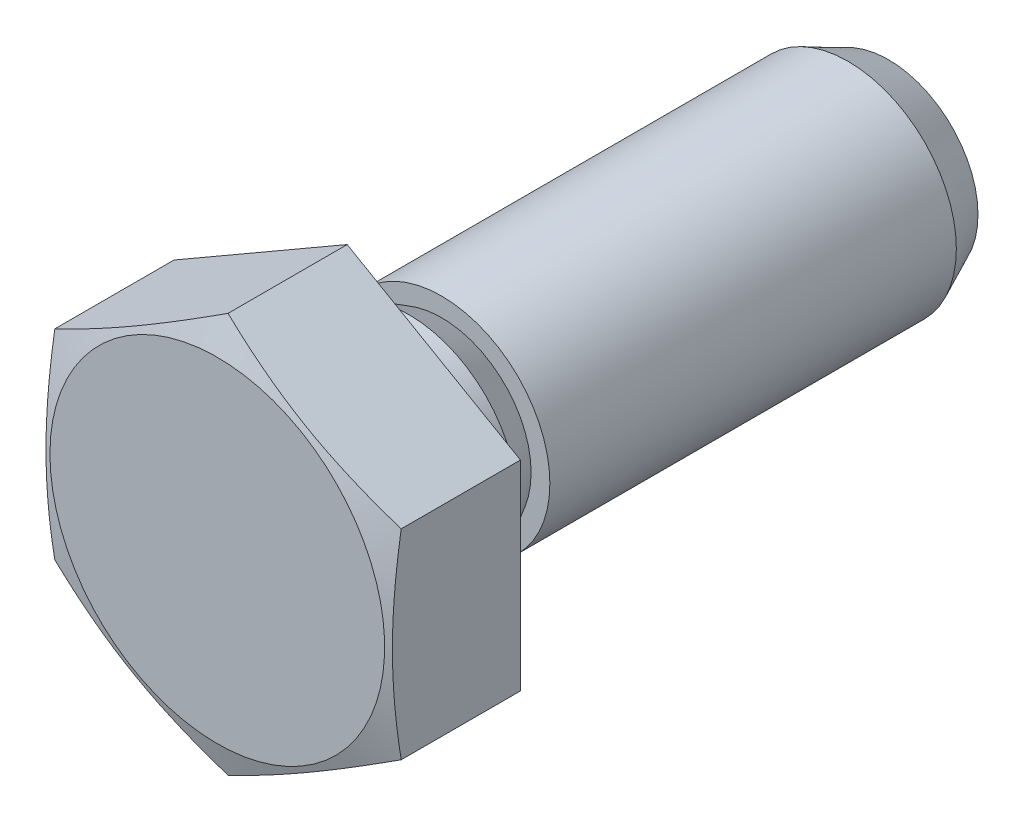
ISO-10303-21;
HEADER;
FILE_DESCRIPTION(('STEP AP214'),'2;1');
FILE_NAME('part.step','',(''),(''),'','','');
FILE_SCHEMA(('AUTOMOTIVE_DESIGN { 1 0 10303 214 1 1 1 1 }'));
ENDSEC;
DATA;
#1=APPLICATION_CONTEXT('core data for automotive mechanical design processes');
#2=APPLICATION_PROTOCOL_DEFINITION('international standard','automotive_design',2000,#1);
#3=PRODUCT_CONTEXT('',#1,'mechanical');
#4=PRODUCT('Part','Part','',(#3));
#5=PRODUCT_RELATED_PRODUCT_CATEGORY('part','',(#4));
#6=PRODUCT_DEFINITION_FORMATION('','',#4);
#7=PRODUCT_DEFINITION_CONTEXT('part definition',#1,'design');
#8=PRODUCT_DEFINITION('design','',#6,#7);
#9=PRODUCT_DEFINITION_SHAPE('','',#8);
#10=(LENGTH_UNIT() NAMED_UNIT(*) SI_UNIT(.MILLI.,.METRE.));
#11=(NAMED_UNIT(*) PLANE_ANGLE_UNIT() SI_UNIT($,.RADIAN.));
#12=(NAMED_UNIT(*) SI_UNIT($,.STERADIAN.) SOLID_ANGLE_UNIT());
#13=UNCERTAINTY_MEASURE_WITH_UNIT(LENGTH_MEASURE(1.E-05),#10,'distance_accuracy_value','');
#14=(GEOMETRIC_REPRESENTATION_CONTEXT(3) GLOBAL_UNCERTAINTY_ASSIGNED_CONTEXT((#13)) GLOBAL_UNIT_ASSIGNED_CONTEXT((#10,
#11,#12)) REPRESENTATION_CONTEXT('',''));
#15=CARTESIAN_POINT('',(0.,0.,0.));
#16=DIRECTION('',(0.,0.,1.));
#17=DIRECTION('',(1.,0.,0.));
#18=AXIS2_PLACEMENT_3D('',#15,#16,#17);
#19=CARTESIAN_POINT('',(0.,0.,0.5));
#20=DIRECTION('',(0.,0.,1.));
#21=DIRECTION('',(1.,0.,0.));
#22=AXIS2_PLACEMENT_3D('',#19,#20,#21);
#23=TOROIDAL_SURFACE('',#22,2.94,0.5);
#24=CARTESIAN_POINT('',(0.,0.,0.5));
#25=DIRECTION('',(0.,0.,1.));
#26=DIRECTION('',(1.,0.,0.));
#27=AXIS2_PLACEMENT_3D('',#24,#25,#26);
#28=CIRCLE('',#27,3.44);
#29=CARTESIAN_POINT('',(3.44,0.,0.5));
#30=VERTEX_POINT('',#29);
#31=EDGE_CURVE('E10',#30,#30,#28,.T.);
#32=ORIENTED_EDGE('',*,*,#31,.F.);
#33=EDGE_LOOP('',(#32));
#34=FACE_BOUND('',#33,.T.);
#35=CARTESIAN_POINT('',(0.,0.,0.));
#36=DIRECTION('',(0.,0.,1.));
#37=DIRECTION('',(1.,0.,0.));
#38=AXIS2_PLACEMENT_3D('',#35,#36,#37);
#39=CIRCLE('',#38,2.94);
#40=CARTESIAN_POINT('',(2.94,0.,0.));
#41=VERTEX_POINT('',#40);
#42=EDGE_CURVE('E22',#41,#41,#39,.T.);
#43=ORIENTED_EDGE('',*,*,#42,.T.);
#44=EDGE_LOOP('',(#43));
#45=FACE_BOUND('',#44,.T.);
#46=ADVANCED_FACE('F15',(#34,#45),#23,.T.);
#47=CARTESIAN_POINT('',(0.,2.94,0.));
#48=DIRECTION('',(0.,0.,-1.));
#49=DIRECTION('',(-1.,0.,0.));
#50=AXIS2_PLACEMENT_3D('',#47,#48,#49);
#51=PLANE('',#50);
#52=CARTESIAN_POINT('',(0.,0.,0.));
#53=DIRECTION('',(0.,0.,1.));
#54=DIRECTION('',(1.,0.,0.));
#55=AXIS2_PLACEMENT_3D('',#52,#53,#54);
#56=CIRCLE('',#55,2.75);
#57=CARTESIAN_POINT('',(2.75,0.,0.));
#58=VERTEX_POINT('',#57);
#59=EDGE_CURVE('E116',#58,#58,#56,.T.);
#60=ORIENTED_EDGE('',*,*,#59,.T.);
#61=EDGE_LOOP('',(#60));
#62=FACE_BOUND('',#61,.T.);
#63=ORIENTED_EDGE('',*,*,#42,.F.);
#64=EDGE_LOOP('',(#63));
#65=FACE_BOUND('',#64,.T.);
#66=ADVANCED_FACE('F122',(#62,#65),#51,.T.);
#67=CARTESIAN_POINT('',(0.,0.,-0.25));
#68=DIRECTION('',(0.,0.,1.));
#69=DIRECTION('',(1.,0.,0.));
#70=AXIS2_PLACEMENT_3D('',#67,#68,#69);
#71=TOROIDAL_SURFACE('',#70,2.75,0.25);
#72=CARTESIAN_POINT('',(0.,0.,-0.25));
#73=DIRECTION('',(0.,0.,1.));
#74=DIRECTION('',(1.,0.,0.));
#75=AXIS2_PLACEMENT_3D('',#72,#73,#74);
#76=CIRCLE('',#75,2.5);
#77=CARTESIAN_POINT('',(2.5,0.,-0.25));
#78=VERTEX_POINT('',#77);
#79=EDGE_CURVE('E113',#78,#78,#76,.T.);
#80=ORIENTED_EDGE('',*,*,#79,.T.);
#81=EDGE_LOOP('',(#80));
#82=FACE_BOUND('',#81,.T.);
#83=ORIENTED_EDGE('',*,*,#59,.F.);
#84=EDGE_LOOP('',(#83));
#85=FACE_BOUND('',#84,.T.);
#86=ADVANCED_FACE('F124',(#82,#85),#71,.F.);
#87=CARTESIAN_POINT('',(0.,0.,0.5));
#88=DIRECTION('',(0.,0.,1.));
#89=DIRECTION('',(1.,0.,0.));
#90=AXIS2_PLACEMENT_3D('',#87,#88,#89);
#91=CYLINDRICAL_SURFACE('',#90,2.5);
#92=CARTESIAN_POINT('',(0.,0.,-0.930022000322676));
#93=DIRECTION('',(0.,0.,1.));
#94=DIRECTION('',(1.,0.,0.));
#95=AXIS2_PLACEMENT_3D('',#92,#93,#94);
#96=CIRCLE('',#95,2.5);
#97=CARTESIAN_POINT('',(2.5,0.,-0.930022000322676));
#98=VERTEX_POINT('',#97);
#99=EDGE_CURVE('E110',#98,#98,#96,.T.);
#100=ORIENTED_EDGE('',*,*,#99,.T.);
#101=EDGE_LOOP('',(#100));
#102=FACE_BOUND('',#101,.T.);
#103=ORIENTED_EDGE('',*,*,#79,.F.);
#104=EDGE_LOOP('',(#103));
#105=FACE_BOUND('',#104,.T.);
#106=ADVANCED_FACE('F131',(#102,#105),#91,.T.);
#107=CARTESIAN_POINT('',(0.,0.,-0.930022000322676));
#108=DIRECTION('',(0.,0.,1.));
#109=DIRECTION('',(1.,0.,0.));
#110=AXIS2_PLACEMENT_3D('',#107,#108,#109);
#111=CONICAL_SURFACE('',#110,2.5,0.523598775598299);
#112=CARTESIAN_POINT('',(0.,0.,-1.68));
#113=DIRECTION('',(0.,0.,1.));
#114=DIRECTION('',(1.,0.,0.));
#115=AXIS2_PLACEMENT_3D('',#112,#113,#114);
#116=CIRCLE('',#115,2.067);
#117=CARTESIAN_POINT('',(2.067,0.,-1.68));
#118=VERTEX_POINT('',#117);
#119=EDGE_CURVE('E107',#118,#118,#116,.T.);
#120=ORIENTED_EDGE('',*,*,#119,.T.);
#121=EDGE_LOOP('',(#120));
#122=FACE_BOUND('',#121,.T.);
#123=ORIENTED_EDGE('',*,*,#99,.F.);
#124=EDGE_LOOP('',(#123));
#125=FACE_BOUND('',#124,.T.);
#126=ADVANCED_FACE('F138',(#122,#125),#111,.T.);
#127=CARTESIAN_POINT('',(0.,2.067,-1.68));
#128=DIRECTION('',(0.,0.,1.));
#129=DIRECTION('',(1.,0.,0.));
#130=AXIS2_PLACEMENT_3D('',#127,#128,#129);
#131=PLANE('',#130);
#132=CARTESIAN_POINT('',(0.,0.,-1.68));
#133=DIRECTION('',(0.,0.,1.));
#134=DIRECTION('',(1.,0.,0.));
#135=AXIS2_PLACEMENT_3D('',#132,#133,#134);
#136=CIRCLE('',#135,2.5);
#137=CARTESIAN_POINT('',(2.5,0.,-1.68));
#138=VERTEX_POINT('',#137);
#139=EDGE_CURVE('E104',#138,#138,#136,.T.);
#140=ORIENTED_EDGE('',*,*,#139,.T.);
#141=EDGE_LOOP('',(#140));
#142=FACE_BOUND('',#141,.T.);
#143=ORIENTED_EDGE('',*,*,#119,.F.);
#144=EDGE_LOOP('',(#143));
#145=FACE_BOUND('',#144,.T.);
#146=ADVANCED_FACE('F142',(#142,#145),#131,.T.);
#147=CARTESIAN_POINT('',(0.,0.,0.5));
#148=DIRECTION('',(0.,0.,1.));
#149=DIRECTION('',(1.,0.,0.));
#150=AXIS2_PLACEMENT_3D('',#147,#148,#149);
#151=CYLINDRICAL_SURFACE('',#150,2.5);
#152=CARTESIAN_POINT('',(0.,0.,-11.067));
#153=DIRECTION('',(0.,0.,1.));
#154=DIRECTION('',(1.,0.,0.));
#155=AXIS2_PLACEMENT_3D('',#152,#153,#154);
#156=CIRCLE('',#155,2.5);
#157=CARTESIAN_POINT('',(2.5,0.,-11.067));
#158=VERTEX_POINT('',#157);
#159=EDGE_CURVE('E101',#158,#158,#156,.T.);
#160=ORIENTED_EDGE('',*,*,#159,.T.);
#161=EDGE_LOOP('',(#160));
#162=FACE_BOUND('',#161,.T.);
#163=ORIENTED_EDGE('',*,*,#139,.F.);
#164=EDGE_LOOP('',(#163));
#165=FACE_BOUND('',#164,.T.);
#166=ADVANCED_FACE('F146',(#162,#165),#151,.T.);
#167=CARTESIAN_POINT('',(0.,0.,-11.067));
#168=DIRECTION('',(0.,0.,1.));
#169=DIRECTION('',(1.,0.,0.));
#170=AXIS2_PLACEMENT_3D('',#167,#168,#169);
#171=CONICAL_SURFACE('',#170,2.5,0.43451274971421);
#172=CARTESIAN_POINT('',(0.,0.,-12.));
#173=DIRECTION('',(0.,0.,1.));
#174=DIRECTION('',(1.,0.,0.));
#175=AXIS2_PLACEMENT_3D('',#172,#173,#174);
#176=CIRCLE('',#175,2.067);
#177=CARTESIAN_POINT('',(2.067,0.,-12.));
#178=VERTEX_POINT('',#177);
#179=EDGE_CURVE('E98',#178,#178,#176,.T.);
#180=ORIENTED_EDGE('',*,*,#179,.T.);
#181=EDGE_LOOP('',(#180));
#182=FACE_BOUND('',#181,.T.);
#183=ORIENTED_EDGE('',*,*,#159,.F.);
#184=EDGE_LOOP('',(#183));
#185=FACE_BOUND('',#184,.T.);
#186=ADVANCED_FACE('F150',(#182,#185),#171,.T.);
#187=CARTESIAN_POINT('',(0.,2.067,-12.));
#188=DIRECTION('',(0.,0.,-1.));
#189=DIRECTION('',(-1.,0.,0.));
#190=AXIS2_PLACEMENT_3D('',#187,#188,#189);
#191=PLANE('',#190);
#192=ORIENTED_EDGE('',*,*,#179,.F.);
#193=EDGE_LOOP('',(#192));
#194=FACE_BOUND('',#193,.T.);
#195=ADVANCED_FACE('F154',(#194),#191,.T.);
#196=CARTESIAN_POINT('',(-4.,-2.3094,0.5));
#197=DIRECTION('',(0.,0.,-1.));
#198=DIRECTION('',(-1.,0.,0.));
#199=AXIS2_PLACEMENT_3D('',#196,#197,#198);
#200=PLANE('',#199);
#201=DIRECTION('',(0.,-1.,0.));
#202=VECTOR('',#201,1.);
#203=CARTESIAN_POINT('',(-4.,2.3094,0.5));
#204=LINE('',#203,#202);
#205=CARTESIAN_POINT('',(-4.,2.3094,0.5));
#206=VERTEX_POINT('',#205);
#207=CARTESIAN_POINT('',(-4.,-2.3094,0.5));
#208=VERTEX_POINT('',#207);
#209=EDGE_CURVE('E81',#206,#208,#204,.T.);
#210=ORIENTED_EDGE('',*,*,#209,.F.);
#211=DIRECTION('',(0.866025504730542,0.499999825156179,0.));
#212=VECTOR('',#211,1.);
#213=CARTESIAN_POINT('',(-4.,2.3094,0.5));
#214=LINE('',#213,#212);
#215=CARTESIAN_POINT('',(0.,4.6188,0.5));
#216=VERTEX_POINT('',#215);
#217=EDGE_CURVE('E86',#206,#216,#214,.T.);
#218=ORIENTED_EDGE('',*,*,#217,.T.);
#219=DIRECTION('',(0.866025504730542,-0.499999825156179,0.));
#220=VECTOR('',#219,1.);
#221=CARTESIAN_POINT('',(0.,4.6188,0.5));
#222=LINE('',#221,#220);
#223=CARTESIAN_POINT('',(4.,2.3094,0.5));
#224=VERTEX_POINT('',#223);
#225=EDGE_CURVE('E92',#216,#224,#222,.T.);
#226=ORIENTED_EDGE('',*,*,#225,.T.);
#227=DIRECTION('',(0.,-1.,0.));
#228=VECTOR('',#227,1.);
#229=CARTESIAN_POINT('',(4.,2.3094,0.5));
#230=LINE('',#229,#228);
#231=CARTESIAN_POINT('',(4.,-2.3094,0.5));
#232=VERTEX_POINT('',#231);
#233=EDGE_CURVE('E244',#224,#232,#230,.T.);
#234=ORIENTED_EDGE('',*,*,#233,.T.);
#235=DIRECTION('',(-0.866025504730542,-0.499999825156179,0.));
#236=VECTOR('',#235,1.);
#237=CARTESIAN_POINT('',(4.,-2.3094,0.5));
#238=LINE('',#237,#236);
#239=CARTESIAN_POINT('',(0.,-4.6188,0.5));
#240=VERTEX_POINT('',#239);
#241=EDGE_CURVE('E230',#232,#240,#238,.T.);
#242=ORIENTED_EDGE('',*,*,#241,.T.);
#243=DIRECTION('',(-0.866025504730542,0.499999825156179,0.));
#244=VECTOR('',#243,1.);
#245=CARTESIAN_POINT('',(0.,-4.6188,0.5));
#246=LINE('',#245,#244);
#247=EDGE_CURVE('E228',#240,#208,#246,.T.);
#248=ORIENTED_EDGE('',*,*,#247,.T.);
#249=EDGE_LOOP('',(#210,#218,#226,#234,#242,#248));
#250=FACE_BOUND('',#249,.T.);
#251=ORIENTED_EDGE('',*,*,#31,.T.);
#252=EDGE_LOOP('',(#251));
#253=FACE_BOUND('',#252,.T.);
#254=ADVANCED_FACE('F158',(#250,#253),#200,.T.);
#255=CARTESIAN_POINT('',(-4.,2.3094,0.5));
#256=DIRECTION('',(-1.,0.,0.));
#257=DIRECTION('',(0.,0.,1.));
#258=AXIS2_PLACEMENT_3D('',#255,#256,#257);
#259=PLANE('',#258);
#260=CARTESIAN_POINT('',(-4.,2.66662995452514,3.19024582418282));
#261=CARTESIAN_POINT('',(-4.,2.48418475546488,3.22350153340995));
#262=CARTESIAN_POINT('',(-4.,2.30129241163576,3.25449531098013));
#263=CARTESIAN_POINT('',(-4.,1.93455333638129,3.3109075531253));
#264=CARTESIAN_POINT('',(-4.,1.7507061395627,3.33632297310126));
#265=CARTESIAN_POINT('',(-4.,1.38237526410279,3.38046702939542));
#266=CARTESIAN_POINT('',(-4.,1.19789237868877,3.39920214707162));
#267=CARTESIAN_POINT('',(-4.,0.82833495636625,3.42902381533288));
#268=CARTESIAN_POINT('',(-4.,0.64326054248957,3.44011186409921));
#269=CARTESIAN_POINT('',(-4.,0.275434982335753,3.45386479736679));
#270=CARTESIAN_POINT('',(-4.,0.0926883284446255,3.45664750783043));
#271=CARTESIAN_POINT('',(-4.,-0.272751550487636,3.45394498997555));
#272=CARTESIAN_POINT('',(-4.,-0.455444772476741,3.44845935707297));
#273=CARTESIAN_POINT('',(-4.,-0.820363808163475,3.42957062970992));
#274=CARTESIAN_POINT('',(-4.,-1.00258973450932,3.41616966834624));
#275=CARTESIAN_POINT('',(-4.,-1.36636648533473,3.3822217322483));
#276=CARTESIAN_POINT('',(-4.,-1.54791729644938,3.36167461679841));
#277=CARTESIAN_POINT('',(-4.,-1.91302688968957,3.31405859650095));
#278=CARTESIAN_POINT('',(-4.,-2.09657289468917,3.28689308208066));
#279=CARTESIAN_POINT('',(-4.,-2.46279812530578,3.2272893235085));
#280=CARTESIAN_POINT('',(-4.,-2.64547734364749,3.19485103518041));
#281=CARTESIAN_POINT('',(-4.,-3.01014914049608,3.12565761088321));
#282=CARTESIAN_POINT('',(-4.,-3.19214111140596,3.08889930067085));
#283=CARTESIAN_POINT('',(-4.,-3.55539222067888,3.01191845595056));
#284=CARTESIAN_POINT('',(-4.,-3.73665133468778,2.97169580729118));
#285=CARTESIAN_POINT('',(-4.,-4.10158174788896,2.88776479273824));
#286=CARTESIAN_POINT('',(-4.,-4.28524209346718,2.8440090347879));
#287=CARTESIAN_POINT('',(-4.,-4.65199720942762,2.75418610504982));
#288=CARTESIAN_POINT('',(-4.,-4.83509197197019,2.70811890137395));
#289=CARTESIAN_POINT('',(-4.,-5.20040952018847,2.61422409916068));
#290=CARTESIAN_POINT('',(-4.,-5.38263333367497,2.56640048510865));
#291=CARTESIAN_POINT('',(-4.,-5.74666325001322,2.46923414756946));
#292=CARTESIAN_POINT('',(-4.,-5.92846937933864,2.41989152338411));
#293=CARTESIAN_POINT('',(-4.,-6.1101087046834,2.36995326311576));
#294=B_SPLINE_CURVE_WITH_KNOTS('',3,(#260,#261,#262,#263,#264,#265,#266,#267,#268,#269,#270,
#271,#272,#273,#274,#275,#276,#277,#278,#279,#280,#281,#282,#283,#284,#285,#286,#287,#288,#289,
#290,#291,#292,#293),.UNSPECIFIED.,.F.,.F.,(4,2,2,2,2,2,2,2,2,2,2,2,2,2,2,2,4),(0.,
0.55639133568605,1.11308559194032,1.66923825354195,2.22528192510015,2.77339872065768,
3.32154233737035,3.86953830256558,4.41754505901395,4.97408860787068,5.53063681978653,
6.08759655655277,6.64457465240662,7.2109581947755,7.77734955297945,8.34252701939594,
8.90766761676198),.UNSPECIFIED.);
#295=CARTESIAN_POINT('',(-4.,2.3094,3.25223131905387));
#296=VERTEX_POINT('',#295);
#297=CARTESIAN_POINT('',(-4.,-2.3094,3.25223131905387));
#298=VERTEX_POINT('',#297);
#299=EDGE_CURVE('E70',#296,#298,#294,.T.);
#300=ORIENTED_EDGE('',*,*,#299,.F.);
#301=DIRECTION('',(0.,0.,1.));
#302=VECTOR('',#301,1.);
#303=CARTESIAN_POINT('',(-4.,2.3094,0.5));
#304=LINE('',#303,#302);
#305=EDGE_CURVE('E79',#206,#296,#304,.T.);
#306=ORIENTED_EDGE('',*,*,#305,.F.);
#307=ORIENTED_EDGE('',*,*,#209,.T.);
#308=DIRECTION('',(0.,0.,1.));
#309=VECTOR('',#308,1.);
#310=CARTESIAN_POINT('',(-4.,-2.3094,0.5));
#311=LINE('',#310,#309);
#312=EDGE_CURVE('E37',#208,#298,#311,.T.);
#313=ORIENTED_EDGE('',*,*,#312,.T.);
#314=EDGE_LOOP('',(#300,#306,#307,#313));
#315=FACE_BOUND('',#314,.T.);
#316=ADVANCED_FACE('F77',(#315),#259,.T.);
#317=CARTESIAN_POINT('',(0.,-4.6188,0.5));
#318=DIRECTION('',(0.499999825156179,0.866025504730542,0.));
#319=DIRECTION('',(0.866025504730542,-0.499999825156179,0.));
#320=AXIS2_PLACEMENT_3D('',#317,#318,#319);
#321=PLANE('',#320);
#322=DIRECTION('',(0.,0.,1.));
#323=VECTOR('',#322,1.);
#324=CARTESIAN_POINT('',(0.,-4.6188,0.5));
#325=LINE('',#324,#323);
#326=CARTESIAN_POINT('',(0.,-4.6188,3.25223184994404));
#327=VERTEX_POINT('',#326);
#328=EDGE_CURVE('E235',#240,#327,#325,.T.);
#329=ORIENTED_EDGE('',*,*,#328,.T.);
#330=CARTESIAN_POINT('',(2.00000000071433E-07,-4.61880011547,3.25223181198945));
#331=CARTESIAN_POINT('',(-0.165833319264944,-4.52305613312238,3.28371353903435));
#332=CARTESIAN_POINT('',(-0.332115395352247,-4.42705317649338,3.31232833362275));
#333=CARTESIAN_POINT('',(-0.665562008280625,-4.23453777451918,3.36264341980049));
#334=CARTESIAN_POINT('',(-0.832727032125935,-4.13802504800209,3.38433937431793));
#335=CARTESIAN_POINT('',(-1.16642181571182,-3.94536636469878,3.41945743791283));
#336=CARTESIAN_POINT('',(-1.3329464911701,-3.84922334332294,3.43294223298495));
#337=CARTESIAN_POINT('',(-1.66631419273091,-3.65675350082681,3.45102704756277));
#338=CARTESIAN_POINT('',(-1.83315710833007,-3.56042674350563,3.45562973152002));
#339=CARTESIAN_POINT('',(-2.16684293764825,-3.36777322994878,3.45562967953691));
#340=CARTESIAN_POINT('',(-2.33368585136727,-3.27144647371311,3.45102694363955));
#341=CARTESIAN_POINT('',(-2.66705354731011,-3.0789766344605,3.43294202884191));
#342=CARTESIAN_POINT('',(-2.83357821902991,-2.98283361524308,3.419457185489));
#343=CARTESIAN_POINT('',(-3.16727299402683,-2.7901749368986,3.384339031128));
#344=CARTESIAN_POINT('',(-3.33443801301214,-2.69366221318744,3.36264303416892));
#345=CARTESIAN_POINT('',(-3.66788461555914,-2.50114681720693,3.31232787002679));
#346=CARTESIAN_POINT('',(-3.83416668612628,-2.40514386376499,3.28371303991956));
#347=CARTESIAN_POINT('',(-4.0000002,-2.30939988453,3.25223128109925));
#348=B_SPLINE_CURVE_WITH_KNOTS('',3,(#330,#331,#332,#333,#334,#335,#336,#337,#338,#339,#340,
#341,#342,#343,#344,#345,#346,#347),.UNSPECIFIED.,.F.,.F.,(4,2,2,2,2,2,2,2,4),(0.,
0.582223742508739,1.16481173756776,1.74289445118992,2.32080372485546,2.89871299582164,
3.47679570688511,4.05938369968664,4.64160743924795),.UNSPECIFIED.);
#349=EDGE_CURVE('E82',#327,#298,#348,.T.);
#350=ORIENTED_EDGE('',*,*,#349,.T.);
#351=ORIENTED_EDGE('',*,*,#312,.F.);
#352=ORIENTED_EDGE('',*,*,#247,.F.);
#353=EDGE_LOOP('',(#329,#350,#351,#352));
#354=FACE_BOUND('',#353,.T.);
#355=ADVANCED_FACE('F163',(#354),#321,.F.);
#356=CARTESIAN_POINT('',(4.,-2.3094,0.5));
#357=DIRECTION('',(-0.499999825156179,0.866025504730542,0.));
#358=DIRECTION('',(0.866025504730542,0.499999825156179,0.));
#359=AXIS2_PLACEMENT_3D('',#356,#357,#358);
#360=PLANE('',#359);
#361=DIRECTION('',(0.,0.,1.));
#362=VECTOR('',#361,1.);
#363=CARTESIAN_POINT('',(4.,-2.3094,0.5));
#364=LINE('',#363,#362);
#365=CARTESIAN_POINT('',(4.,-2.3094,3.25223131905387));
#366=VERTEX_POINT('',#365);
#367=EDGE_CURVE('E238',#232,#366,#364,.T.);
#368=ORIENTED_EDGE('',*,*,#367,.T.);
#369=CARTESIAN_POINT('',(4.0000002,-2.30939988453,3.25223128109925));
#370=CARTESIAN_POINT('',(3.83416668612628,-2.40514386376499,3.28371303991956));
#371=CARTESIAN_POINT('',(3.66788461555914,-2.50114681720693,3.31232787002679));
#372=CARTESIAN_POINT('',(3.33443801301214,-2.69366221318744,3.36264303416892));
#373=CARTESIAN_POINT('',(3.16727299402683,-2.79017493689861,3.384339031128));
#374=CARTESIAN_POINT('',(2.83357821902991,-2.98283361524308,3.419457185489));
#375=CARTESIAN_POINT('',(2.66705354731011,-3.07897663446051,3.43294202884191));
#376=CARTESIAN_POINT('',(2.33368585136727,-3.27144647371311,3.45102694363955));
#377=CARTESIAN_POINT('',(2.16684293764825,-3.36777322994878,3.45562967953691));
#378=CARTESIAN_POINT('',(1.83315710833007,-3.56042674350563,3.45562973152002));
#379=CARTESIAN_POINT('',(1.66631419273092,-3.65675350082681,3.45102704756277));
#380=CARTESIAN_POINT('',(1.3329464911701,-3.84922334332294,3.43294223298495));
#381=CARTESIAN_POINT('',(1.16642181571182,-3.94536636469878,3.41945743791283));
#382=CARTESIAN_POINT('',(0.832727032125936,-4.13802504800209,3.38433937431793));
#383=CARTESIAN_POINT('',(0.665562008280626,-4.23453777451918,3.36264341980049));
#384=CARTESIAN_POINT('',(0.332115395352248,-4.42705317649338,3.31232833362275));
#385=CARTESIAN_POINT('',(0.165833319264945,-4.52305613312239,3.28371353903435));
#386=CARTESIAN_POINT('',(-2.00000000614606E-07,-4.61880011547,3.25223181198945));
#387=B_SPLINE_CURVE_WITH_KNOTS('',3,(#369,#370,#371,#372,#373,#374,#375,#376,#377,#378,#379,
#380,#381,#382,#383,#384,#385,#386),.UNSPECIFIED.,.F.,.F.,(4,2,2,2,2,2,2,2,4),(0.,
0.58222373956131,1.16481173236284,1.74289444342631,2.3208037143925,2.89871298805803,
3.47679570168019,4.05938369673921,4.64160743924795),.UNSPECIFIED.);
#388=EDGE_CURVE('E201',#366,#327,#387,.T.);
#389=ORIENTED_EDGE('',*,*,#388,.T.);
#390=ORIENTED_EDGE('',*,*,#328,.F.);
#391=ORIENTED_EDGE('',*,*,#241,.F.);
#392=EDGE_LOOP('',(#368,#389,#390,#391));
#393=FACE_BOUND('',#392,.T.);
#394=ADVANCED_FACE('F206',(#393),#360,.F.);
#395=CARTESIAN_POINT('',(4.,2.3094,0.5));
#396=DIRECTION('',(-1.,0.,0.));
#397=DIRECTION('',(0.,0.,1.));
#398=AXIS2_PLACEMENT_3D('',#395,#396,#397);
#399=PLANE('',#398);
#400=DIRECTION('',(0.,0.,1.));
#401=VECTOR('',#400,1.);
#402=CARTESIAN_POINT('',(4.,2.3094,0.5));
#403=LINE('',#402,#401);
#404=CARTESIAN_POINT('',(4.,2.3094,3.25223131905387));
#405=VERTEX_POINT('',#404);
#406=EDGE_CURVE('E90',#224,#405,#403,.T.);
#407=ORIENTED_EDGE('',*,*,#406,.T.);
#408=CARTESIAN_POINT('',(4.,2.66662995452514,3.19024582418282));
#409=CARTESIAN_POINT('',(4.,2.48418475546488,3.22350153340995));
#410=CARTESIAN_POINT('',(4.,2.30129241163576,3.25449531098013));
#411=CARTESIAN_POINT('',(4.,1.93455333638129,3.3109075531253));
#412=CARTESIAN_POINT('',(4.,1.7507061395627,3.33632297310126));
#413=CARTESIAN_POINT('',(4.,1.38237526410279,3.38046702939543));
#414=CARTESIAN_POINT('',(4.,1.19789237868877,3.39920214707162));
#415=CARTESIAN_POINT('',(4.,0.82833495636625,3.42902381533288));
#416=CARTESIAN_POINT('',(4.,0.64326054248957,3.44011186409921));
#417=CARTESIAN_POINT('',(4.,0.275434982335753,3.45386479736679));
#418=CARTESIAN_POINT('',(4.,0.0926883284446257,3.45664750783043));
#419=CARTESIAN_POINT('',(4.,-0.272751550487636,3.45394498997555));
#420=CARTESIAN_POINT('',(4.,-0.45544477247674,3.44845935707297));
#421=CARTESIAN_POINT('',(4.,-0.820363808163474,3.42957062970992));
#422=CARTESIAN_POINT('',(4.,-1.00258973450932,3.41616966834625));
#423=CARTESIAN_POINT('',(4.,-1.36636648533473,3.3822217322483));
#424=CARTESIAN_POINT('',(4.,-1.54791729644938,3.36167461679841));
#425=CARTESIAN_POINT('',(4.,-1.91302688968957,3.31405859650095));
#426=CARTESIAN_POINT('',(4.,-2.09657289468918,3.28689308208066));
#427=CARTESIAN_POINT('',(4.,-2.46279812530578,3.2272893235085));
#428=CARTESIAN_POINT('',(4.,-2.64547734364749,3.19485103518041));
#429=CARTESIAN_POINT('',(4.,-3.01014914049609,3.12565761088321));
#430=CARTESIAN_POINT('',(4.,-3.19214111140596,3.08889930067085));
#431=CARTESIAN_POINT('',(4.,-3.55539222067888,3.01191845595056));
#432=CARTESIAN_POINT('',(4.,-3.73665133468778,2.97169580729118));
#433=CARTESIAN_POINT('',(4.,-4.10158174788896,2.88776479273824));
#434=CARTESIAN_POINT('',(4.,-4.28524209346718,2.8440090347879));
#435=CARTESIAN_POINT('',(4.,-4.65199720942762,2.75418610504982));
#436=CARTESIAN_POINT('',(4.,-4.83509197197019,2.70811890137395));
#437=CARTESIAN_POINT('',(4.,-5.20040952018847,2.61422409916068));
#438=CARTESIAN_POINT('',(4.,-5.38263333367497,2.56640048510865));
#439=CARTESIAN_POINT('',(4.,-5.74666325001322,2.46923414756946));
#440=CARTESIAN_POINT('',(4.,-5.92846937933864,2.41989152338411));
#441=CARTESIAN_POINT('',(4.,-6.1101087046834,2.36995326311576));
#442=B_SPLINE_CURVE_WITH_KNOTS('',3,(#408,#409,#410,#411,#412,#413,#414,#415,#416,#417,#418,
#419,#420,#421,#422,#423,#424,#425,#426,#427,#428,#429,#430,#431,#432,#433,#434,#435,#436,#437,
#438,#439,#440,#441),.UNSPECIFIED.,.F.,.F.,(4,2,2,2,2,2,2,2,2,2,2,2,2,2,2,2,4),(0.,
0.55639133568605,1.11308559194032,1.66923825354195,2.22528192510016,2.77339872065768,
3.32154233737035,3.86953830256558,4.41754505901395,4.97408860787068,5.53063681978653,
6.08759655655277,6.64457465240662,7.2109581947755,7.77734955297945,8.34252701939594,
8.90766761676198),.UNSPECIFIED.);
#443=EDGE_CURVE('E196',#405,#366,#442,.T.);
#444=ORIENTED_EDGE('',*,*,#443,.T.);
#445=ORIENTED_EDGE('',*,*,#367,.F.);
#446=ORIENTED_EDGE('',*,*,#233,.F.);
#447=EDGE_LOOP('',(#407,#444,#445,#446));
#448=FACE_BOUND('',#447,.T.);
#449=ADVANCED_FACE('F209',(#448),#399,.F.);
#450=CARTESIAN_POINT('',(0.,4.6188,0.5));
#451=DIRECTION('',(-0.499999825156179,-0.866025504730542,0.));
#452=DIRECTION('',(-0.866025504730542,0.499999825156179,0.));
#453=AXIS2_PLACEMENT_3D('',#450,#451,#452);
#454=PLANE('',#453);
#455=DIRECTION('',(0.,0.,1.));
#456=VECTOR('',#455,1.);
#457=CARTESIAN_POINT('',(0.,4.6188,0.5));
#458=LINE('',#457,#456);
#459=CARTESIAN_POINT('',(0.,4.6188,3.25223184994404));
#460=VERTEX_POINT('',#459);
#461=EDGE_CURVE('E88',#216,#460,#458,.T.);
#462=ORIENTED_EDGE('',*,*,#461,.T.);
#463=CARTESIAN_POINT('',(-1.99999999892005E-07,4.61880011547,3.25223181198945));
#464=CARTESIAN_POINT('',(0.165833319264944,4.52305613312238,3.28371353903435));
#465=CARTESIAN_POINT('',(0.332115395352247,4.42705317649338,3.31232833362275));
#466=CARTESIAN_POINT('',(0.665562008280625,4.23453777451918,3.36264341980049));
#467=CARTESIAN_POINT('',(0.832727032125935,4.13802504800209,3.38433937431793));
#468=CARTESIAN_POINT('',(1.16642181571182,3.94536636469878,3.41945743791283));
#469=CARTESIAN_POINT('',(1.3329464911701,3.84922334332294,3.43294223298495));
#470=CARTESIAN_POINT('',(1.66631419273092,3.65675350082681,3.45102704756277));
#471=CARTESIAN_POINT('',(1.83315710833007,3.56042674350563,3.45562973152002));
#472=CARTESIAN_POINT('',(2.16684293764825,3.36777322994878,3.45562967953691));
#473=CARTESIAN_POINT('',(2.33368585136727,3.27144647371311,3.45102694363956));
#474=CARTESIAN_POINT('',(2.66705354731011,3.0789766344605,3.43294202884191));
#475=CARTESIAN_POINT('',(2.83357821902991,2.98283361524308,3.419457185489));
#476=CARTESIAN_POINT('',(3.16727299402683,2.7901749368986,3.384339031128));
#477=CARTESIAN_POINT('',(3.33443801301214,2.69366221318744,3.36264303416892));
#478=CARTESIAN_POINT('',(3.66788461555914,2.50114681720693,3.31232787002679));
#479=CARTESIAN_POINT('',(3.83416668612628,2.40514386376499,3.28371303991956));
#480=CARTESIAN_POINT('',(4.0000002,2.30939988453,3.25223128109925));
#481=B_SPLINE_CURVE_WITH_KNOTS('',3,(#463,#464,#465,#466,#467,#468,#469,#470,#471,#472,#473,
#474,#475,#476,#477,#478,#479,#480),.UNSPECIFIED.,.F.,.F.,(4,2,2,2,2,2,2,2,4),(0.,
0.582223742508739,1.16481173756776,1.74289445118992,2.32080372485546,2.89871299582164,
3.47679570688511,4.05938369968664,4.64160743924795),.UNSPECIFIED.);
#482=EDGE_CURVE('E29',#460,#405,#481,.T.);
#483=ORIENTED_EDGE('',*,*,#482,.T.);
#484=ORIENTED_EDGE('',*,*,#406,.F.);
#485=ORIENTED_EDGE('',*,*,#225,.F.);
#486=EDGE_LOOP('',(#462,#483,#484,#485));
#487=FACE_BOUND('',#486,.T.);
#488=ADVANCED_FACE('F213',(#487),#454,.F.);
#489=CARTESIAN_POINT('',(-4.,2.3094,0.5));
#490=DIRECTION('',(0.499999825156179,-0.866025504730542,0.));
#491=DIRECTION('',(-0.866025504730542,-0.499999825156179,0.));
#492=AXIS2_PLACEMENT_3D('',#489,#490,#491);
#493=PLANE('',#492);
#494=ORIENTED_EDGE('',*,*,#305,.T.);
#495=CARTESIAN_POINT('',(-4.0000002,2.30939988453,3.25223128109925));
#496=CARTESIAN_POINT('',(-3.83416668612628,2.40514386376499,3.28371303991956));
#497=CARTESIAN_POINT('',(-3.66788461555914,2.50114681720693,3.31232787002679));
#498=CARTESIAN_POINT('',(-3.33443801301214,2.69366221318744,3.36264303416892));
#499=CARTESIAN_POINT('',(-3.16727299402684,2.79017493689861,3.38433903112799));
#500=CARTESIAN_POINT('',(-2.83357821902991,2.98283361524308,3.419457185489));
#501=CARTESIAN_POINT('',(-2.66705354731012,3.07897663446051,3.43294202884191));
#502=CARTESIAN_POINT('',(-2.33368585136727,3.27144647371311,3.45102694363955));
#503=CARTESIAN_POINT('',(-2.16684293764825,3.36777322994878,3.45562967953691));
#504=CARTESIAN_POINT('',(-1.83315710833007,3.56042674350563,3.45562973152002));
#505=CARTESIAN_POINT('',(-1.66631419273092,3.65675350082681,3.45102704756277));
#506=CARTESIAN_POINT('',(-1.3329464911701,3.84922334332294,3.43294223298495));
#507=CARTESIAN_POINT('',(-1.16642181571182,3.94536636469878,3.41945743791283));
#508=CARTESIAN_POINT('',(-0.832727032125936,4.13802504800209,3.38433937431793));
#509=CARTESIAN_POINT('',(-0.665562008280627,4.23453777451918,3.36264341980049));
#510=CARTESIAN_POINT('',(-0.332115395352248,4.42705317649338,3.31232833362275));
#511=CARTESIAN_POINT('',(-0.165833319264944,4.52305613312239,3.28371353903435));
#512=CARTESIAN_POINT('',(2.00000001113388E-07,4.61880011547,3.25223181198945));
#513=B_SPLINE_CURVE_WITH_KNOTS('',3,(#495,#496,#497,#498,#499,#500,#501,#502,#503,#504,#505,
#506,#507,#508,#509,#510,#511,#512),.UNSPECIFIED.,.F.,.F.,(4,2,2,2,2,2,2,2,4),(0.,
0.582223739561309,1.16481173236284,1.74289444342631,2.3208037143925,2.89871298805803,
3.47679570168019,4.05938369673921,4.64160743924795),.UNSPECIFIED.);
#514=EDGE_CURVE('E66',#296,#460,#513,.T.);
#515=ORIENTED_EDGE('',*,*,#514,.T.);
#516=ORIENTED_EDGE('',*,*,#461,.F.);
#517=ORIENTED_EDGE('',*,*,#217,.F.);
#518=EDGE_LOOP('',(#494,#515,#516,#517));
#519=FACE_BOUND('',#518,.T.);
#520=ADVANCED_FACE('F84',(#519),#493,.F.);
#521=CARTESIAN_POINT('',(0.,0.,3.22186818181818));
#522=DIRECTION('',(0.,0.,-1.));
#523=DIRECTION('',(-1.,0.,0.));
#524=AXIS2_PLACEMENT_3D('',#521,#522,#523);
#525=CONICAL_SURFACE('',#524,4.711176,1.25322470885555);
#526=ORIENTED_EDGE('',*,*,#299,.T.);
#527=ORIENTED_EDGE('',*,*,#349,.F.);
#528=ORIENTED_EDGE('',*,*,#388,.F.);
#529=ORIENTED_EDGE('',*,*,#443,.F.);
#530=ORIENTED_EDGE('',*,*,#482,.F.);
#531=ORIENTED_EDGE('',*,*,#514,.F.);
#532=EDGE_LOOP('',(#526,#527,#528,#529,#530,#531));
#533=FACE_BOUND('',#532,.T.);
#534=CARTESIAN_POINT('',(0.,0.,3.5));
#535=DIRECTION('',(0.,0.,-1.));
#536=DIRECTION('',(-1.,0.,0.));
#537=AXIS2_PLACEMENT_3D('',#534,#535,#536);
#538=CIRCLE('',#537,3.86500995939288);
#539=CARTESIAN_POINT('',(-3.86500995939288,0.,3.5));
#540=VERTEX_POINT('',#539);
#541=EDGE_CURVE('E74',#540,#540,#538,.F.);
#542=ORIENTED_EDGE('',*,*,#541,.F.);
#543=EDGE_LOOP('',(#542));
#544=FACE_BOUND('',#543,.T.);
#545=ADVANCED_FACE('F68',(#533,#544),#525,.T.);
#546=CARTESIAN_POINT('',(-4.,-2.3094,3.5));
#547=DIRECTION('',(0.,0.,-1.));
#548=DIRECTION('',(-1.,0.,0.));
#549=AXIS2_PLACEMENT_3D('',#546,#547,#548);
#550=PLANE('',#549);
#551=ORIENTED_EDGE('',*,*,#541,.T.);
#552=EDGE_LOOP('',(#551));
#553=FACE_BOUND('',#552,.T.);
#554=ADVANCED_FACE('F179',(#553),#550,.F.);
#555=CLOSED_SHELL('',(#46,#66,#86,#106,#126,#146,#166,#186,#195,#254,#316,#355,#394,#449,#488,
#520,#545,#554));
#556=MANIFOLD_SOLID_BREP('B1',#555);
#557=ADVANCED_BREP_SHAPE_REPRESENTATION('',(#18,#556),#14);
#558=SHAPE_DEFINITION_REPRESENTATION(#9,#557);
ENDSEC;
END-ISO-10303-21;
